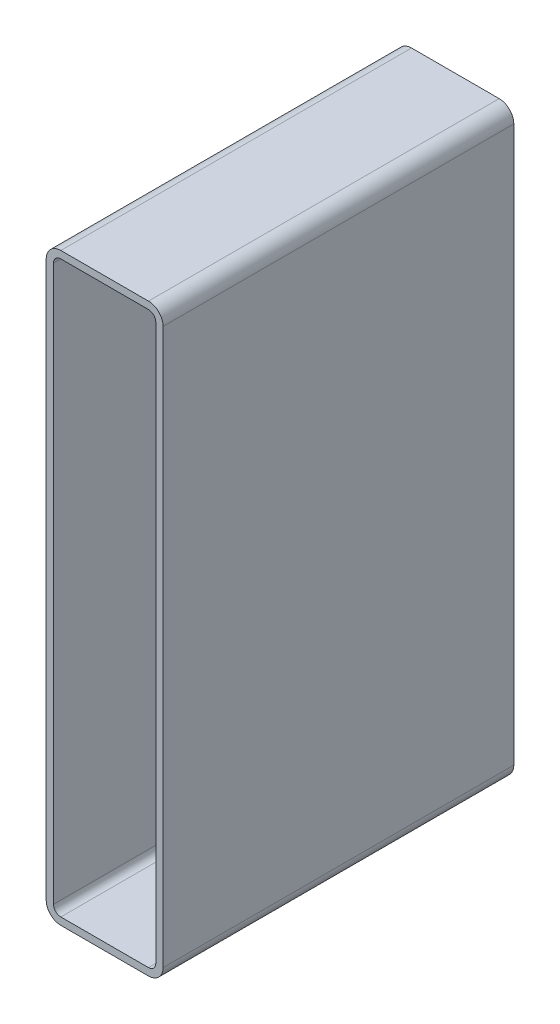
ISO-10303-21;
HEADER;
FILE_DESCRIPTION(('STEP AP214'),'2;1');
FILE_NAME('part.step','',(''),(''),'','','');
FILE_SCHEMA(('AUTOMOTIVE_DESIGN { 1 0 10303 214 1 1 1 1 }'));
ENDSEC;
DATA;
#1=APPLICATION_CONTEXT('core data for automotive mechanical design processes');
#2=APPLICATION_PROTOCOL_DEFINITION('international standard','automotive_design',2000,#1);
#3=PRODUCT_CONTEXT('',#1,'mechanical');
#4=PRODUCT('Part','Part','',(#3));
#5=PRODUCT_RELATED_PRODUCT_CATEGORY('part','',(#4));
#6=PRODUCT_DEFINITION_FORMATION('','',#4);
#7=PRODUCT_DEFINITION_CONTEXT('part definition',#1,'design');
#8=PRODUCT_DEFINITION('design','',#6,#7);
#9=PRODUCT_DEFINITION_SHAPE('','',#8);
#10=(LENGTH_UNIT() NAMED_UNIT(*) SI_UNIT(.MILLI.,.METRE.));
#11=(NAMED_UNIT(*) PLANE_ANGLE_UNIT() SI_UNIT($,.RADIAN.));
#12=(NAMED_UNIT(*) SI_UNIT($,.STERADIAN.) SOLID_ANGLE_UNIT());
#13=UNCERTAINTY_MEASURE_WITH_UNIT(LENGTH_MEASURE(1.E-05),#10,'distance_accuracy_value','');
#14=(GEOMETRIC_REPRESENTATION_CONTEXT(3) GLOBAL_UNCERTAINTY_ASSIGNED_CONTEXT((#13)) GLOBAL_UNIT_ASSIGNED_CONTEXT((#10,
#11,#12)) REPRESENTATION_CONTEXT('',''));
#15=CARTESIAN_POINT('',(0.,0.,0.));
#16=DIRECTION('',(0.,0.,1.));
#17=DIRECTION('',(1.,0.,0.));
#18=AXIS2_PLACEMENT_3D('',#15,#16,#17);
#19=CARTESIAN_POINT('',(90.5751778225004,14.3912282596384,304.8));
#20=DIRECTION('',(0.,0.,1.));
#21=DIRECTION('',(1.,0.,0.));
#22=AXIS2_PLACEMENT_3D('',#19,#20,#21);
#23=PLANE('',#22);
#24=CARTESIAN_POINT('',(90.5751778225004,14.3912282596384,304.8));
#25=DIRECTION('',(0.,0.,1.));
#26=DIRECTION('',(1.,0.,0.));
#27=AXIS2_PLACEMENT_3D('',#24,#25,#26);
#28=CIRCLE('',#27,12.7);
#29=CARTESIAN_POINT('',(90.5751778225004,1.69122825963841,304.8));
#30=VERTEX_POINT('',#29);
#31=CARTESIAN_POINT('',(103.2751778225,14.3912282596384,304.8));
#32=VERTEX_POINT('',#31);
#33=EDGE_CURVE('E211',#30,#32,#28,.T.);
#34=ORIENTED_EDGE('',*,*,#33,.T.);
#35=DIRECTION('',(0.,1.,0.));
#36=VECTOR('',#35,1.);
#37=CARTESIAN_POINT('',(103.2751778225,496.991228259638,304.8));
#38=LINE('',#37,#36);
#39=CARTESIAN_POINT('',(103.2751778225,496.991228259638,304.8));
#40=VERTEX_POINT('',#39);
#41=EDGE_CURVE('E214',#32,#40,#38,.T.);
#42=ORIENTED_EDGE('',*,*,#41,.T.);
#43=CARTESIAN_POINT('',(90.5751778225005,496.991228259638,304.8));
#44=DIRECTION('',(0.,0.,1.));
#45=DIRECTION('',(1.,0.,0.));
#46=AXIS2_PLACEMENT_3D('',#43,#44,#45);
#47=CIRCLE('',#46,12.7);
#48=CARTESIAN_POINT('',(90.5751778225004,509.691228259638,304.8));
#49=VERTEX_POINT('',#48);
#50=EDGE_CURVE('E217',#40,#49,#47,.T.);
#51=ORIENTED_EDGE('',*,*,#50,.T.);
#52=DIRECTION('',(-1.,0.,0.));
#53=VECTOR('',#52,1.);
#54=CARTESIAN_POINT('',(14.3751778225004,509.691228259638,304.8));
#55=LINE('',#54,#53);
#56=CARTESIAN_POINT('',(14.3751778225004,509.691228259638,304.8));
#57=VERTEX_POINT('',#56);
#58=EDGE_CURVE('E219',#49,#57,#55,.T.);
#59=ORIENTED_EDGE('',*,*,#58,.T.);
#60=CARTESIAN_POINT('',(14.3751778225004,496.991228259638,304.8));
#61=DIRECTION('',(0.,0.,1.));
#62=DIRECTION('',(1.,0.,0.));
#63=AXIS2_PLACEMENT_3D('',#60,#61,#62);
#64=CIRCLE('',#63,12.7);
#65=CARTESIAN_POINT('',(1.67517782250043,496.991228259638,304.8));
#66=VERTEX_POINT('',#65);
#67=EDGE_CURVE('E221',#57,#66,#64,.T.);
#68=ORIENTED_EDGE('',*,*,#67,.T.);
#69=DIRECTION('',(0.,-1.,0.));
#70=VECTOR('',#69,1.);
#71=CARTESIAN_POINT('',(1.67517782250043,14.3912282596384,304.8));
#72=LINE('',#71,#70);
#73=CARTESIAN_POINT('',(1.67517782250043,14.3912282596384,304.8));
#74=VERTEX_POINT('',#73);
#75=EDGE_CURVE('E223',#66,#74,#72,.T.);
#76=ORIENTED_EDGE('',*,*,#75,.T.);
#77=CARTESIAN_POINT('',(14.3751778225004,14.3912282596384,304.8));
#78=DIRECTION('',(0.,0.,1.));
#79=DIRECTION('',(1.,0.,0.));
#80=AXIS2_PLACEMENT_3D('',#77,#78,#79);
#81=CIRCLE('',#80,12.7);
#82=CARTESIAN_POINT('',(14.3751778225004,1.69122825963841,304.8));
#83=VERTEX_POINT('',#82);
#84=EDGE_CURVE('E225',#74,#83,#81,.T.);
#85=ORIENTED_EDGE('',*,*,#84,.T.);
#86=DIRECTION('',(1.,0.,0.));
#87=VECTOR('',#86,1.);
#88=CARTESIAN_POINT('',(90.5751778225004,1.69122825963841,304.8));
#89=LINE('',#88,#87);
#90=EDGE_CURVE('E227',#83,#30,#89,.T.);
#91=ORIENTED_EDGE('',*,*,#90,.T.);
#92=EDGE_LOOP('',(#34,#42,#51,#59,#68,#76,#85,#91));
#93=FACE_BOUND('',#92,.T.);
#94=DIRECTION('',(0.,-1.,0.));
#95=VECTOR('',#94,1.);
#96=CARTESIAN_POINT('',(8.02517782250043,14.3912282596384,304.8));
#97=LINE('',#96,#95);
#98=CARTESIAN_POINT('',(8.02517782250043,496.991228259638,304.8));
#99=VERTEX_POINT('',#98);
#100=CARTESIAN_POINT('',(8.02517782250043,14.3912282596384,304.8));
#101=VERTEX_POINT('',#100);
#102=EDGE_CURVE('E154',#99,#101,#97,.T.);
#103=ORIENTED_EDGE('',*,*,#102,.F.);
#104=CARTESIAN_POINT('',(14.3751778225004,496.991228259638,304.8));
#105=DIRECTION('',(0.,0.,1.));
#106=DIRECTION('',(1.,0.,0.));
#107=AXIS2_PLACEMENT_3D('',#104,#105,#106);
#108=CIRCLE('',#107,6.35000000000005);
#109=CARTESIAN_POINT('',(14.3751778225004,503.341228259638,304.8));
#110=VERTEX_POINT('',#109);
#111=EDGE_CURVE('E146',#110,#99,#108,.T.);
#112=ORIENTED_EDGE('',*,*,#111,.F.);
#113=DIRECTION('',(-1.,0.,0.));
#114=VECTOR('',#113,1.);
#115=CARTESIAN_POINT('',(14.3751778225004,503.341228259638,304.8));
#116=LINE('',#115,#114);
#117=CARTESIAN_POINT('',(90.5751778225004,503.341228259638,304.8));
#118=VERTEX_POINT('',#117);
#119=EDGE_CURVE('E179',#118,#110,#116,.T.);
#120=ORIENTED_EDGE('',*,*,#119,.F.);
#121=CARTESIAN_POINT('',(90.5751778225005,496.991228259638,304.8));
#122=DIRECTION('',(0.,0.,1.));
#123=DIRECTION('',(1.,0.,0.));
#124=AXIS2_PLACEMENT_3D('',#121,#122,#123);
#125=CIRCLE('',#124,6.35000000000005);
#126=CARTESIAN_POINT('',(96.9251778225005,496.991228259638,304.8));
#127=VERTEX_POINT('',#126);
#128=EDGE_CURVE('E177',#127,#118,#125,.T.);
#129=ORIENTED_EDGE('',*,*,#128,.F.);
#130=DIRECTION('',(0.,1.,0.));
#131=VECTOR('',#130,1.);
#132=CARTESIAN_POINT('',(96.9251778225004,496.991228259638,304.8));
#133=LINE('',#132,#131);
#134=CARTESIAN_POINT('',(96.9251778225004,14.3912282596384,304.8));
#135=VERTEX_POINT('',#134);
#136=EDGE_CURVE('E175',#135,#127,#133,.T.);
#137=ORIENTED_EDGE('',*,*,#136,.F.);
#138=CARTESIAN_POINT('',(90.5751778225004,14.3912282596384,304.8));
#139=DIRECTION('',(0.,0.,1.));
#140=DIRECTION('',(1.,0.,0.));
#141=AXIS2_PLACEMENT_3D('',#138,#139,#140);
#142=CIRCLE('',#141,6.35000000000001);
#143=CARTESIAN_POINT('',(90.5751778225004,8.04122825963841,304.8));
#144=VERTEX_POINT('',#143);
#145=EDGE_CURVE('E173',#144,#135,#142,.T.);
#146=ORIENTED_EDGE('',*,*,#145,.F.);
#147=DIRECTION('',(1.,0.,0.));
#148=VECTOR('',#147,1.);
#149=CARTESIAN_POINT('',(90.5751778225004,8.04122825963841,304.8));
#150=LINE('',#149,#148);
#151=CARTESIAN_POINT('',(14.3751778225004,8.04122825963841,304.8));
#152=VERTEX_POINT('',#151);
#153=EDGE_CURVE('E169',#152,#144,#150,.T.);
#154=ORIENTED_EDGE('',*,*,#153,.F.);
#155=CARTESIAN_POINT('',(14.3751778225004,14.3912282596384,304.8));
#156=DIRECTION('',(0.,0.,1.));
#157=DIRECTION('',(1.,0.,0.));
#158=AXIS2_PLACEMENT_3D('',#155,#156,#157);
#159=CIRCLE('',#158,6.35);
#160=EDGE_CURVE('E167',#101,#152,#159,.T.);
#161=ORIENTED_EDGE('',*,*,#160,.F.);
#162=EDGE_LOOP('',(#103,#112,#120,#129,#137,#146,#154,#161));
#163=FACE_BOUND('',#162,.T.);
#164=ADVANCED_FACE('F33',(#93,#163),#23,.T.);
#165=CARTESIAN_POINT('',(90.5751778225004,14.3912282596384,0.));
#166=DIRECTION('',(0.,0.,1.));
#167=DIRECTION('',(1.,0.,0.));
#168=AXIS2_PLACEMENT_3D('',#165,#166,#167);
#169=PLANE('',#168);
#170=CARTESIAN_POINT('',(90.5751778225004,14.3912282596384,0.));
#171=DIRECTION('',(0.,0.,1.));
#172=DIRECTION('',(1.,0.,0.));
#173=AXIS2_PLACEMENT_3D('',#170,#171,#172);
#174=CIRCLE('',#173,12.7);
#175=CARTESIAN_POINT('',(90.5751778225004,1.69122825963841,0.));
#176=VERTEX_POINT('',#175);
#177=CARTESIAN_POINT('',(103.2751778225,14.3912282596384,0.));
#178=VERTEX_POINT('',#177);
#179=EDGE_CURVE('E162',#176,#178,#174,.T.);
#180=ORIENTED_EDGE('',*,*,#179,.F.);
#181=DIRECTION('',(1.,0.,0.));
#182=VECTOR('',#181,1.);
#183=CARTESIAN_POINT('',(90.5751778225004,1.69122825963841,0.));
#184=LINE('',#183,#182);
#185=CARTESIAN_POINT('',(14.3751778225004,1.69122825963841,0.));
#186=VERTEX_POINT('',#185);
#187=EDGE_CURVE('E215',#186,#176,#184,.T.);
#188=ORIENTED_EDGE('',*,*,#187,.F.);
#189=CARTESIAN_POINT('',(14.3751778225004,14.3912282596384,0.));
#190=DIRECTION('',(0.,0.,1.));
#191=DIRECTION('',(1.,0.,0.));
#192=AXIS2_PLACEMENT_3D('',#189,#190,#191);
#193=CIRCLE('',#192,12.7);
#194=CARTESIAN_POINT('',(1.67517782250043,14.3912282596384,0.));
#195=VERTEX_POINT('',#194);
#196=EDGE_CURVE('E242',#195,#186,#193,.T.);
#197=ORIENTED_EDGE('',*,*,#196,.F.);
#198=DIRECTION('',(0.,-1.,0.));
#199=VECTOR('',#198,1.);
#200=CARTESIAN_POINT('',(1.67517782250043,14.3912282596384,0.));
#201=LINE('',#200,#199);
#202=CARTESIAN_POINT('',(1.67517782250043,496.991228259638,0.));
#203=VERTEX_POINT('',#202);
#204=EDGE_CURVE('E240',#203,#195,#201,.T.);
#205=ORIENTED_EDGE('',*,*,#204,.F.);
#206=CARTESIAN_POINT('',(14.3751778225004,496.991228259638,0.));
#207=DIRECTION('',(0.,0.,1.));
#208=DIRECTION('',(1.,0.,0.));
#209=AXIS2_PLACEMENT_3D('',#206,#207,#208);
#210=CIRCLE('',#209,12.7);
#211=CARTESIAN_POINT('',(14.3751778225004,509.691228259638,0.));
#212=VERTEX_POINT('',#211);
#213=EDGE_CURVE('E238',#212,#203,#210,.T.);
#214=ORIENTED_EDGE('',*,*,#213,.F.);
#215=DIRECTION('',(-1.,0.,0.));
#216=VECTOR('',#215,1.);
#217=CARTESIAN_POINT('',(14.3751778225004,509.691228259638,0.));
#218=LINE('',#217,#216);
#219=CARTESIAN_POINT('',(90.5751778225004,509.691228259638,0.));
#220=VERTEX_POINT('',#219);
#221=EDGE_CURVE('E236',#220,#212,#218,.T.);
#222=ORIENTED_EDGE('',*,*,#221,.F.);
#223=CARTESIAN_POINT('',(90.5751778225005,496.991228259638,0.));
#224=DIRECTION('',(0.,0.,1.));
#225=DIRECTION('',(1.,0.,0.));
#226=AXIS2_PLACEMENT_3D('',#223,#224,#225);
#227=CIRCLE('',#226,12.7);
#228=CARTESIAN_POINT('',(103.2751778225,496.991228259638,0.));
#229=VERTEX_POINT('',#228);
#230=EDGE_CURVE('E234',#229,#220,#227,.T.);
#231=ORIENTED_EDGE('',*,*,#230,.F.);
#232=DIRECTION('',(0.,1.,0.));
#233=VECTOR('',#232,1.);
#234=CARTESIAN_POINT('',(103.2751778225,496.991228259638,0.));
#235=LINE('',#234,#233);
#236=EDGE_CURVE('E232',#178,#229,#235,.T.);
#237=ORIENTED_EDGE('',*,*,#236,.F.);
#238=EDGE_LOOP('',(#180,#188,#197,#205,#214,#222,#231,#237));
#239=FACE_BOUND('',#238,.T.);
#240=CARTESIAN_POINT('',(14.3751778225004,496.991228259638,0.));
#241=DIRECTION('',(0.,0.,1.));
#242=DIRECTION('',(1.,0.,0.));
#243=AXIS2_PLACEMENT_3D('',#240,#241,#242);
#244=CIRCLE('',#243,6.35000000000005);
#245=CARTESIAN_POINT('',(14.3751778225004,503.341228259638,0.));
#246=VERTEX_POINT('',#245);
#247=CARTESIAN_POINT('',(8.02517782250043,496.991228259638,0.));
#248=VERTEX_POINT('',#247);
#249=EDGE_CURVE('E56',#246,#248,#244,.T.);
#250=ORIENTED_EDGE('',*,*,#249,.T.);
#251=DIRECTION('',(0.,-1.,0.));
#252=VECTOR('',#251,1.);
#253=CARTESIAN_POINT('',(8.02517782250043,14.3912282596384,0.));
#254=LINE('',#253,#252);
#255=CARTESIAN_POINT('',(8.02517782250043,14.3912282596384,0.));
#256=VERTEX_POINT('',#255);
#257=EDGE_CURVE('E161',#248,#256,#254,.T.);
#258=ORIENTED_EDGE('',*,*,#257,.T.);
#259=CARTESIAN_POINT('',(14.3751778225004,14.3912282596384,0.));
#260=DIRECTION('',(0.,0.,1.));
#261=DIRECTION('',(1.,0.,0.));
#262=AXIS2_PLACEMENT_3D('',#259,#260,#261);
#263=CIRCLE('',#262,6.35);
#264=CARTESIAN_POINT('',(14.3751778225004,8.04122825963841,0.));
#265=VERTEX_POINT('',#264);
#266=EDGE_CURVE('E183',#256,#265,#263,.T.);
#267=ORIENTED_EDGE('',*,*,#266,.T.);
#268=DIRECTION('',(1.,0.,0.));
#269=VECTOR('',#268,1.);
#270=CARTESIAN_POINT('',(90.5751778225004,8.04122825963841,0.));
#271=LINE('',#270,#269);
#272=CARTESIAN_POINT('',(90.5751778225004,8.04122825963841,0.));
#273=VERTEX_POINT('',#272);
#274=EDGE_CURVE('E186',#265,#273,#271,.T.);
#275=ORIENTED_EDGE('',*,*,#274,.T.);
#276=CARTESIAN_POINT('',(90.5751778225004,14.3912282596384,0.));
#277=DIRECTION('',(0.,0.,1.));
#278=DIRECTION('',(1.,0.,0.));
#279=AXIS2_PLACEMENT_3D('',#276,#277,#278);
#280=CIRCLE('',#279,6.35000000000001);
#281=CARTESIAN_POINT('',(96.9251778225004,14.3912282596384,0.));
#282=VERTEX_POINT('',#281);
#283=EDGE_CURVE('E189',#273,#282,#280,.T.);
#284=ORIENTED_EDGE('',*,*,#283,.T.);
#285=DIRECTION('',(0.,1.,0.));
#286=VECTOR('',#285,1.);
#287=CARTESIAN_POINT('',(96.9251778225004,496.991228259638,0.));
#288=LINE('',#287,#286);
#289=CARTESIAN_POINT('',(96.9251778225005,496.991228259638,0.));
#290=VERTEX_POINT('',#289);
#291=EDGE_CURVE('E192',#282,#290,#288,.T.);
#292=ORIENTED_EDGE('',*,*,#291,.T.);
#293=CARTESIAN_POINT('',(90.5751778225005,496.991228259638,0.));
#294=DIRECTION('',(0.,0.,1.));
#295=DIRECTION('',(1.,0.,0.));
#296=AXIS2_PLACEMENT_3D('',#293,#294,#295);
#297=CIRCLE('',#296,6.35000000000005);
#298=CARTESIAN_POINT('',(90.5751778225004,503.341228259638,0.));
#299=VERTEX_POINT('',#298);
#300=EDGE_CURVE('E195',#290,#299,#297,.T.);
#301=ORIENTED_EDGE('',*,*,#300,.T.);
#302=DIRECTION('',(-1.,0.,0.));
#303=VECTOR('',#302,1.);
#304=CARTESIAN_POINT('',(14.3751778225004,503.341228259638,0.));
#305=LINE('',#304,#303);
#306=EDGE_CURVE('E155',#299,#246,#305,.T.);
#307=ORIENTED_EDGE('',*,*,#306,.T.);
#308=EDGE_LOOP('',(#250,#258,#267,#275,#284,#292,#301,#307));
#309=FACE_BOUND('',#308,.T.);
#310=ADVANCED_FACE('F272',(#239,#309),#169,.F.);
#311=CARTESIAN_POINT('',(90.5751778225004,14.3912282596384,304.8));
#312=DIRECTION('',(0.,0.,-1.));
#313=DIRECTION('',(-1.,0.,0.));
#314=AXIS2_PLACEMENT_3D('',#311,#312,#313);
#315=CYLINDRICAL_SURFACE('',#314,12.7);
#316=ORIENTED_EDGE('',*,*,#179,.T.);
#317=DIRECTION('',(0.,0.,-1.));
#318=VECTOR('',#317,1.);
#319=CARTESIAN_POINT('',(103.2751778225,14.3912282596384,304.8));
#320=LINE('',#319,#318);
#321=EDGE_CURVE('E11',#32,#178,#320,.T.);
#322=ORIENTED_EDGE('',*,*,#321,.F.);
#323=ORIENTED_EDGE('',*,*,#33,.F.);
#324=DIRECTION('',(0.,0.,-1.));
#325=VECTOR('',#324,1.);
#326=CARTESIAN_POINT('',(90.5751778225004,1.69122825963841,304.8));
#327=LINE('',#326,#325);
#328=EDGE_CURVE('E229',#30,#176,#327,.T.);
#329=ORIENTED_EDGE('',*,*,#328,.T.);
#330=EDGE_LOOP('',(#316,#322,#323,#329));
#331=FACE_BOUND('',#330,.T.);
#332=ADVANCED_FACE('F35',(#331),#315,.T.);
#333=CARTESIAN_POINT('',(103.2751778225,496.991228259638,304.8));
#334=DIRECTION('',(-1.,0.,0.));
#335=DIRECTION('',(0.,0.,1.));
#336=AXIS2_PLACEMENT_3D('',#333,#334,#335);
#337=PLANE('',#336);
#338=ORIENTED_EDGE('',*,*,#236,.T.);
#339=DIRECTION('',(0.,0.,-1.));
#340=VECTOR('',#339,1.);
#341=CARTESIAN_POINT('',(103.2751778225,496.991228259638,304.8));
#342=LINE('',#341,#340);
#343=EDGE_CURVE('E41',#40,#229,#342,.T.);
#344=ORIENTED_EDGE('',*,*,#343,.F.);
#345=ORIENTED_EDGE('',*,*,#41,.F.);
#346=ORIENTED_EDGE('',*,*,#321,.T.);
#347=EDGE_LOOP('',(#338,#344,#345,#346));
#348=FACE_BOUND('',#347,.T.);
#349=ADVANCED_FACE('F289',(#348),#337,.F.);
#350=CARTESIAN_POINT('',(90.5751778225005,496.991228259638,304.8));
#351=DIRECTION('',(0.,0.,-1.));
#352=DIRECTION('',(-1.,0.,0.));
#353=AXIS2_PLACEMENT_3D('',#350,#351,#352);
#354=CYLINDRICAL_SURFACE('',#353,12.7);
#355=ORIENTED_EDGE('',*,*,#230,.T.);
#356=DIRECTION('',(0.,0.,-1.));
#357=VECTOR('',#356,1.);
#358=CARTESIAN_POINT('',(90.5751778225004,509.691228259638,304.8));
#359=LINE('',#358,#357);
#360=EDGE_CURVE('E259',#49,#220,#359,.T.);
#361=ORIENTED_EDGE('',*,*,#360,.F.);
#362=ORIENTED_EDGE('',*,*,#50,.F.);
#363=ORIENTED_EDGE('',*,*,#343,.T.);
#364=EDGE_LOOP('',(#355,#361,#362,#363));
#365=FACE_BOUND('',#364,.T.);
#366=ADVANCED_FACE('F266',(#365),#354,.T.);
#367=CARTESIAN_POINT('',(14.3751778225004,509.691228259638,304.8));
#368=DIRECTION('',(0.,-1.,0.));
#369=DIRECTION('',(0.,0.,-1.));
#370=AXIS2_PLACEMENT_3D('',#367,#368,#369);
#371=PLANE('',#370);
#372=ORIENTED_EDGE('',*,*,#221,.T.);
#373=DIRECTION('',(0.,0.,-1.));
#374=VECTOR('',#373,1.);
#375=CARTESIAN_POINT('',(14.3751778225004,509.691228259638,304.8));
#376=LINE('',#375,#374);
#377=EDGE_CURVE('E256',#57,#212,#376,.T.);
#378=ORIENTED_EDGE('',*,*,#377,.F.);
#379=ORIENTED_EDGE('',*,*,#58,.F.);
#380=ORIENTED_EDGE('',*,*,#360,.T.);
#381=EDGE_LOOP('',(#372,#378,#379,#380));
#382=FACE_BOUND('',#381,.T.);
#383=ADVANCED_FACE('F278',(#382),#371,.F.);
#384=CARTESIAN_POINT('',(14.3751778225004,496.991228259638,304.8));
#385=DIRECTION('',(0.,0.,-1.));
#386=DIRECTION('',(-1.,0.,0.));
#387=AXIS2_PLACEMENT_3D('',#384,#385,#386);
#388=CYLINDRICAL_SURFACE('',#387,12.7);
#389=ORIENTED_EDGE('',*,*,#213,.T.);
#390=DIRECTION('',(0.,0.,-1.));
#391=VECTOR('',#390,1.);
#392=CARTESIAN_POINT('',(1.67517782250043,496.991228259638,304.8));
#393=LINE('',#392,#391);
#394=EDGE_CURVE('E253',#66,#203,#393,.T.);
#395=ORIENTED_EDGE('',*,*,#394,.F.);
#396=ORIENTED_EDGE('',*,*,#67,.F.);
#397=ORIENTED_EDGE('',*,*,#377,.T.);
#398=EDGE_LOOP('',(#389,#395,#396,#397));
#399=FACE_BOUND('',#398,.T.);
#400=ADVANCED_FACE('F282',(#399),#388,.T.);
#401=CARTESIAN_POINT('',(1.67517782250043,14.3912282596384,304.8));
#402=DIRECTION('',(1.,0.,0.));
#403=DIRECTION('',(0.,0.,-1.));
#404=AXIS2_PLACEMENT_3D('',#401,#402,#403);
#405=PLANE('',#404);
#406=ORIENTED_EDGE('',*,*,#204,.T.);
#407=DIRECTION('',(0.,0.,-1.));
#408=VECTOR('',#407,1.);
#409=CARTESIAN_POINT('',(1.67517782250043,14.3912282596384,304.8));
#410=LINE('',#409,#408);
#411=EDGE_CURVE('E250',#74,#195,#410,.T.);
#412=ORIENTED_EDGE('',*,*,#411,.F.);
#413=ORIENTED_EDGE('',*,*,#75,.F.);
#414=ORIENTED_EDGE('',*,*,#394,.T.);
#415=EDGE_LOOP('',(#406,#412,#413,#414));
#416=FACE_BOUND('',#415,.T.);
#417=ADVANCED_FACE('F302',(#416),#405,.F.);
#418=CARTESIAN_POINT('',(14.3751778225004,14.3912282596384,304.8));
#419=DIRECTION('',(0.,0.,-1.));
#420=DIRECTION('',(-1.,0.,0.));
#421=AXIS2_PLACEMENT_3D('',#418,#419,#420);
#422=CYLINDRICAL_SURFACE('',#421,12.7);
#423=ORIENTED_EDGE('',*,*,#196,.T.);
#424=DIRECTION('',(0.,0.,-1.));
#425=VECTOR('',#424,1.);
#426=CARTESIAN_POINT('',(14.3751778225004,1.69122825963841,304.8));
#427=LINE('',#426,#425);
#428=EDGE_CURVE('E247',#83,#186,#427,.T.);
#429=ORIENTED_EDGE('',*,*,#428,.F.);
#430=ORIENTED_EDGE('',*,*,#84,.F.);
#431=ORIENTED_EDGE('',*,*,#411,.T.);
#432=EDGE_LOOP('',(#423,#429,#430,#431));
#433=FACE_BOUND('',#432,.T.);
#434=ADVANCED_FACE('F300',(#433),#422,.T.);
#435=CARTESIAN_POINT('',(90.5751778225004,1.69122825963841,304.8));
#436=DIRECTION('',(0.,1.,0.));
#437=DIRECTION('',(0.,0.,1.));
#438=AXIS2_PLACEMENT_3D('',#435,#436,#437);
#439=PLANE('',#438);
#440=ORIENTED_EDGE('',*,*,#187,.T.);
#441=ORIENTED_EDGE('',*,*,#328,.F.);
#442=ORIENTED_EDGE('',*,*,#90,.F.);
#443=ORIENTED_EDGE('',*,*,#428,.T.);
#444=EDGE_LOOP('',(#440,#441,#442,#443));
#445=FACE_BOUND('',#444,.T.);
#446=ADVANCED_FACE('F295',(#445),#439,.F.);
#447=CARTESIAN_POINT('',(14.3751778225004,496.991228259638,304.8));
#448=DIRECTION('',(0.,0.,-1.));
#449=DIRECTION('',(-1.,0.,0.));
#450=AXIS2_PLACEMENT_3D('',#447,#448,#449);
#451=CYLINDRICAL_SURFACE('',#450,6.35000000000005);
#452=ORIENTED_EDGE('',*,*,#249,.F.);
#453=DIRECTION('',(0.,0.,-1.));
#454=VECTOR('',#453,1.);
#455=CARTESIAN_POINT('',(14.3751778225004,503.341228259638,304.8));
#456=LINE('',#455,#454);
#457=EDGE_CURVE('E150',#110,#246,#456,.T.);
#458=ORIENTED_EDGE('',*,*,#457,.F.);
#459=ORIENTED_EDGE('',*,*,#111,.T.);
#460=DIRECTION('',(0.,0.,-1.));
#461=VECTOR('',#460,1.);
#462=CARTESIAN_POINT('',(8.02517782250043,496.991228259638,304.8));
#463=LINE('',#462,#461);
#464=EDGE_CURVE('E149',#99,#248,#463,.T.);
#465=ORIENTED_EDGE('',*,*,#464,.T.);
#466=EDGE_LOOP('',(#452,#458,#459,#465));
#467=FACE_BOUND('',#466,.T.);
#468=ADVANCED_FACE('F148',(#467),#451,.F.);
#469=CARTESIAN_POINT('',(8.02517782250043,14.3912282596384,304.8));
#470=DIRECTION('',(1.,0.,0.));
#471=DIRECTION('',(0.,0.,-1.));
#472=AXIS2_PLACEMENT_3D('',#469,#470,#471);
#473=PLANE('',#472);
#474=ORIENTED_EDGE('',*,*,#257,.F.);
#475=ORIENTED_EDGE('',*,*,#464,.F.);
#476=ORIENTED_EDGE('',*,*,#102,.T.);
#477=DIRECTION('',(0.,0.,-1.));
#478=VECTOR('',#477,1.);
#479=CARTESIAN_POINT('',(8.02517782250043,14.3912282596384,304.8));
#480=LINE('',#479,#478);
#481=EDGE_CURVE('E163',#101,#256,#480,.T.);
#482=ORIENTED_EDGE('',*,*,#481,.T.);
#483=EDGE_LOOP('',(#474,#475,#476,#482));
#484=FACE_BOUND('',#483,.T.);
#485=ADVANCED_FACE('F158',(#484),#473,.T.);
#486=CARTESIAN_POINT('',(14.3751778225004,14.3912282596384,304.8));
#487=DIRECTION('',(0.,0.,-1.));
#488=DIRECTION('',(-1.,0.,0.));
#489=AXIS2_PLACEMENT_3D('',#486,#487,#488);
#490=CYLINDRICAL_SURFACE('',#489,6.35);
#491=ORIENTED_EDGE('',*,*,#266,.F.);
#492=ORIENTED_EDGE('',*,*,#481,.F.);
#493=ORIENTED_EDGE('',*,*,#160,.T.);
#494=DIRECTION('',(0.,0.,-1.));
#495=VECTOR('',#494,1.);
#496=CARTESIAN_POINT('',(14.3751778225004,8.04122825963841,304.8));
#497=LINE('',#496,#495);
#498=EDGE_CURVE('E208',#152,#265,#497,.T.);
#499=ORIENTED_EDGE('',*,*,#498,.T.);
#500=EDGE_LOOP('',(#491,#492,#493,#499));
#501=FACE_BOUND('',#500,.T.);
#502=ADVANCED_FACE('F327',(#501),#490,.F.);
#503=CARTESIAN_POINT('',(90.5751778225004,8.04122825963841,304.8));
#504=DIRECTION('',(0.,1.,0.));
#505=DIRECTION('',(0.,0.,1.));
#506=AXIS2_PLACEMENT_3D('',#503,#504,#505);
#507=PLANE('',#506);
#508=ORIENTED_EDGE('',*,*,#274,.F.);
#509=ORIENTED_EDGE('',*,*,#498,.F.);
#510=ORIENTED_EDGE('',*,*,#153,.T.);
#511=DIRECTION('',(0.,0.,-1.));
#512=VECTOR('',#511,1.);
#513=CARTESIAN_POINT('',(90.5751778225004,8.04122825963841,304.8));
#514=LINE('',#513,#512);
#515=EDGE_CURVE('E206',#144,#273,#514,.T.);
#516=ORIENTED_EDGE('',*,*,#515,.T.);
#517=EDGE_LOOP('',(#508,#509,#510,#516));
#518=FACE_BOUND('',#517,.T.);
#519=ADVANCED_FACE('F331',(#518),#507,.T.);
#520=CARTESIAN_POINT('',(90.5751778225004,14.3912282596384,304.8));
#521=DIRECTION('',(0.,0.,-1.));
#522=DIRECTION('',(-1.,0.,0.));
#523=AXIS2_PLACEMENT_3D('',#520,#521,#522);
#524=CYLINDRICAL_SURFACE('',#523,6.35000000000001);
#525=ORIENTED_EDGE('',*,*,#283,.F.);
#526=ORIENTED_EDGE('',*,*,#515,.F.);
#527=ORIENTED_EDGE('',*,*,#145,.T.);
#528=DIRECTION('',(0.,0.,-1.));
#529=VECTOR('',#528,1.);
#530=CARTESIAN_POINT('',(96.9251778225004,14.3912282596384,304.8));
#531=LINE('',#530,#529);
#532=EDGE_CURVE('E204',#135,#282,#531,.T.);
#533=ORIENTED_EDGE('',*,*,#532,.T.);
#534=EDGE_LOOP('',(#525,#526,#527,#533));
#535=FACE_BOUND('',#534,.T.);
#536=ADVANCED_FACE('F337',(#535),#524,.F.);
#537=CARTESIAN_POINT('',(96.9251778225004,496.991228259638,304.8));
#538=DIRECTION('',(-1.,0.,0.));
#539=DIRECTION('',(0.,0.,1.));
#540=AXIS2_PLACEMENT_3D('',#537,#538,#539);
#541=PLANE('',#540);
#542=ORIENTED_EDGE('',*,*,#291,.F.);
#543=ORIENTED_EDGE('',*,*,#532,.F.);
#544=ORIENTED_EDGE('',*,*,#136,.T.);
#545=DIRECTION('',(0.,0.,-1.));
#546=VECTOR('',#545,1.);
#547=CARTESIAN_POINT('',(96.9251778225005,496.991228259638,304.8));
#548=LINE('',#547,#546);
#549=EDGE_CURVE('E202',#127,#290,#548,.T.);
#550=ORIENTED_EDGE('',*,*,#549,.T.);
#551=EDGE_LOOP('',(#542,#543,#544,#550));
#552=FACE_BOUND('',#551,.T.);
#553=ADVANCED_FACE('F341',(#552),#541,.T.);
#554=CARTESIAN_POINT('',(90.5751778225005,496.991228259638,304.8));
#555=DIRECTION('',(0.,0.,-1.));
#556=DIRECTION('',(-1.,0.,0.));
#557=AXIS2_PLACEMENT_3D('',#554,#555,#556);
#558=CYLINDRICAL_SURFACE('',#557,6.35000000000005);
#559=ORIENTED_EDGE('',*,*,#300,.F.);
#560=ORIENTED_EDGE('',*,*,#549,.F.);
#561=ORIENTED_EDGE('',*,*,#128,.T.);
#562=DIRECTION('',(0.,0.,-1.));
#563=VECTOR('',#562,1.);
#564=CARTESIAN_POINT('',(90.5751778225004,503.341228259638,304.8));
#565=LINE('',#564,#563);
#566=EDGE_CURVE('E48',#118,#299,#565,.T.);
#567=ORIENTED_EDGE('',*,*,#566,.T.);
#568=EDGE_LOOP('',(#559,#560,#561,#567));
#569=FACE_BOUND('',#568,.T.);
#570=ADVANCED_FACE('F345',(#569),#558,.F.);
#571=CARTESIAN_POINT('',(14.3751778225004,503.341228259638,304.8));
#572=DIRECTION('',(0.,-1.,0.));
#573=DIRECTION('',(0.,0.,-1.));
#574=AXIS2_PLACEMENT_3D('',#571,#572,#573);
#575=PLANE('',#574);
#576=ORIENTED_EDGE('',*,*,#306,.F.);
#577=ORIENTED_EDGE('',*,*,#566,.F.);
#578=ORIENTED_EDGE('',*,*,#119,.T.);
#579=ORIENTED_EDGE('',*,*,#457,.T.);
#580=EDGE_LOOP('',(#576,#577,#578,#579));
#581=FACE_BOUND('',#580,.T.);
#582=ADVANCED_FACE('F349',(#581),#575,.T.);
#583=CLOSED_SHELL('',(#164,#310,#332,#349,#366,#383,#400,#417,#434,#446,#468,#485,#502,#519,
#536,#553,#570,#582));
#584=MANIFOLD_SOLID_BREP('B2',#583);
#585=ADVANCED_BREP_SHAPE_REPRESENTATION('',(#18,#584),#14);
#586=SHAPE_DEFINITION_REPRESENTATION(#9,#585);
ENDSEC;
END-ISO-10303-21;
